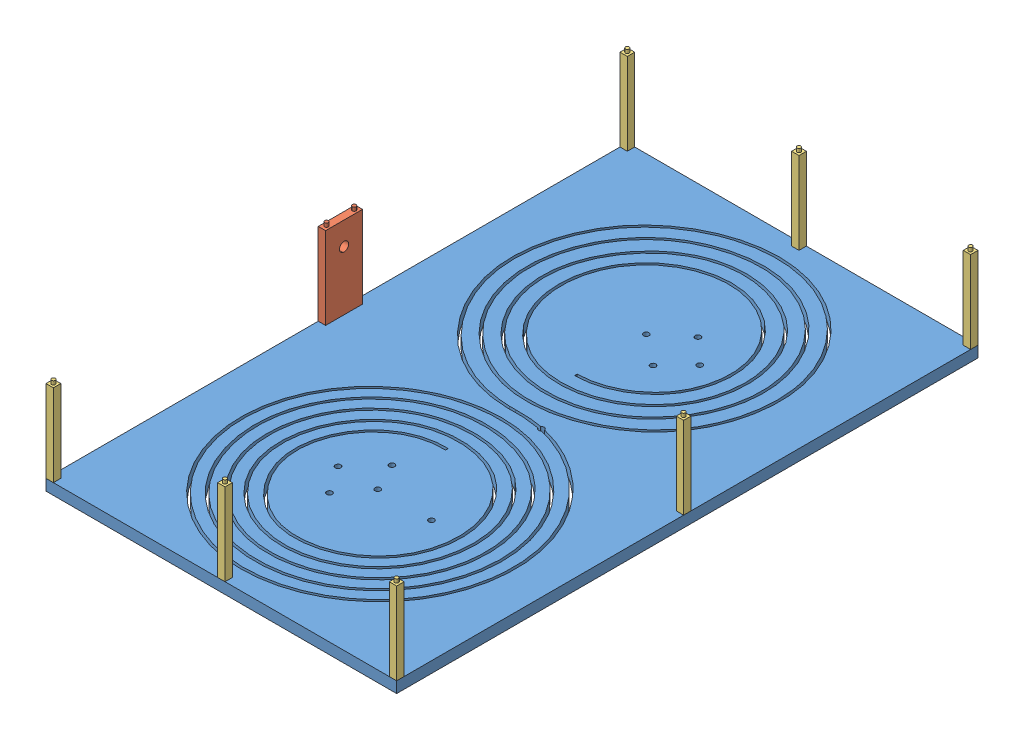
SolidWorks assembly Plate Assembly Back.SLDASM, configuration Default (file format 6000). Lengths in mm.
Overall size (190 52.5 315).
9 component instances, 3 part files, 7 mates.
Components (placement in the parent):
- Plate Back-1: Plate Back.SLDPRT [Default] at origin size (190 6 315)
- Post Axle A Mount-1: Post Axle A Mount.SLDPRT [Default] at (-91 28.25 0) x (0 0 1) z (-1 0 0) size (20 48.5 4)
- Post Front Plate-1: Post Front Plate.SLDPRT [Default] at (-93 6 -155.5) size (4 48.5 4)
- Post Front Plate-2: Post Front Plate.SLDPRT [Default] at (-93 6 155.5) size (4 48.5 4)
- Post Front Plate-3: Post Front Plate.SLDPRT [Default] at (0 6 -155.5) size (4 48.5 4)
- Post Front Plate-4: Post Front Plate.SLDPRT [Default] at (0 6 155.5) size (4 48.5 4)
- Post Front Plate-5: Post Front Plate.SLDPRT [Default] at (93 6 -155.5) size (4 48.5 4)
- Post Front Plate-6: Post Front Plate.SLDPRT [Default] at (93 6 0) size (4 48.5 4)
- Post Front Plate-7: Post Front Plate.SLDPRT [Default] at (93 6 155.5) size (4 48.5 4)
Mates (geometry in assembly coordinates):
- Coincident1: coincident aligned: circle of Plate Back-1; cylinder of Post Axle A Mount-1 through (-93 4 -7.5) axis (0 1 0) radius 1
- Concentric1: concentric anti-aligned: cylinder of Plate Back-1 through (-93 4 7.5) axis (0 1 0) radius 1; cylinder of Post Axle A Mount-1 through (-93 52.5 7.5) axis (0 -1 0) radius 1
- Coincident2: coincident anti-aligned: plane of Plate Back-1 through (0 6 0) normal (0 1 0); plane of Post Axle A Mount-1 through (-95 6 -10) normal (0 -1 0)
- Concentric2: concentric aligned: cylinder of Plate Back-1 through (-93 4 -155.5) axis (0 1 0) radius 1; cylinder of Post Front Plate-1 through (-93 4 -155.5) axis (0 1 0) radius 1
- Coincident3: coincident anti-aligned: plane of Plate Back-1 through (0 6 0) normal (0 1 0); plane of Post Front Plate-1 through (-93 6 -155.5) normal (0 -1 0)
- Parallel1: parallel aligned: plane of Plate Back-1 through (-95 6 157.5) normal (-1 0 0); plane of Post Front Plate-1 through (-95 50.5 -153.5) normal (-1 0 0)
- Coincident4: coordinate: point of Plate Back-1; point of assembly
